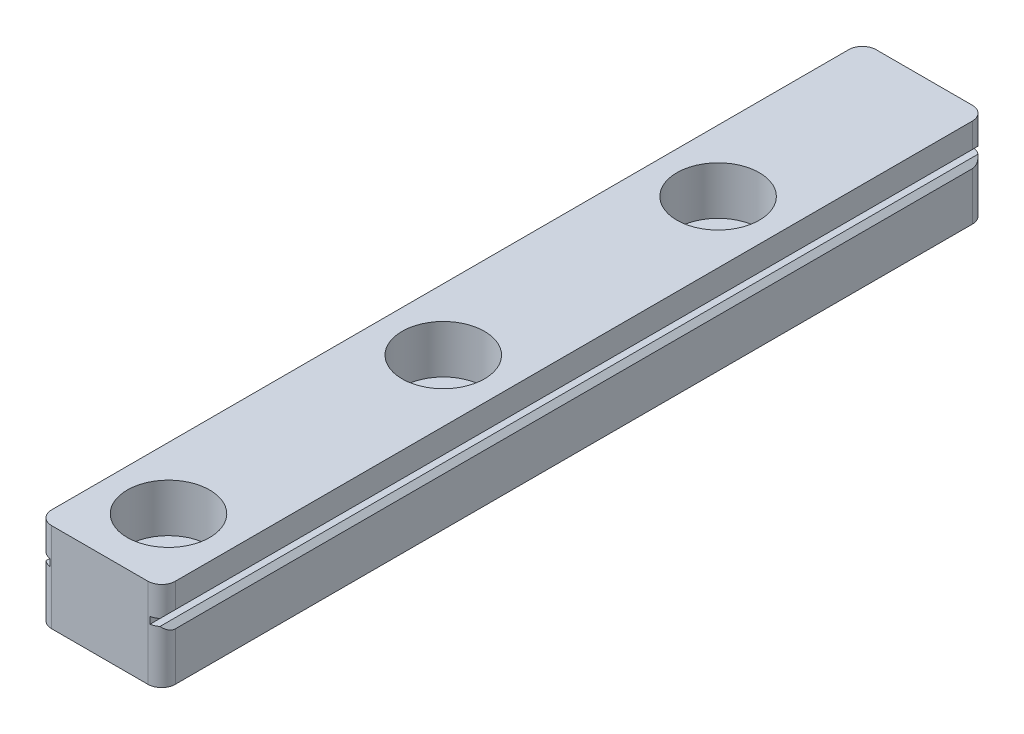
ISO-10303-21;
HEADER;
FILE_DESCRIPTION(('STEP AP214'),'2;1');
FILE_NAME('part.step','',(''),(''),'','','');
FILE_SCHEMA(('AUTOMOTIVE_DESIGN { 1 0 10303 214 1 1 1 1 }'));
ENDSEC;
DATA;
#1=APPLICATION_CONTEXT('core data for automotive mechanical design processes');
#2=APPLICATION_PROTOCOL_DEFINITION('international standard','automotive_design',2000,#1);
#3=PRODUCT_CONTEXT('',#1,'mechanical');
#4=PRODUCT('Part','Part','',(#3));
#5=PRODUCT_RELATED_PRODUCT_CATEGORY('part','',(#4));
#6=PRODUCT_DEFINITION_FORMATION('','',#4);
#7=PRODUCT_DEFINITION_CONTEXT('part definition',#1,'design');
#8=PRODUCT_DEFINITION('design','',#6,#7);
#9=PRODUCT_DEFINITION_SHAPE('','',#8);
#10=(LENGTH_UNIT() NAMED_UNIT(*) SI_UNIT(.MILLI.,.METRE.));
#11=(NAMED_UNIT(*) PLANE_ANGLE_UNIT() SI_UNIT($,.RADIAN.));
#12=(NAMED_UNIT(*) SI_UNIT($,.STERADIAN.) SOLID_ANGLE_UNIT());
#13=UNCERTAINTY_MEASURE_WITH_UNIT(LENGTH_MEASURE(1.E-05),#10,'distance_accuracy_value','');
#14=(GEOMETRIC_REPRESENTATION_CONTEXT(3) GLOBAL_UNCERTAINTY_ASSIGNED_CONTEXT((#13)) GLOBAL_UNIT_ASSIGNED_CONTEXT((#10,
#11,#12)) REPRESENTATION_CONTEXT('',''));
#15=CARTESIAN_POINT('',(0.,0.,0.));
#16=DIRECTION('',(0.,0.,1.));
#17=DIRECTION('',(1.,0.,0.));
#18=AXIS2_PLACEMENT_3D('',#15,#16,#17);
#19=CARTESIAN_POINT('',(0.,0.,-60.));
#20=DIRECTION('',(-1.,0.,0.));
#21=DIRECTION('',(0.,-1.,0.));
#22=AXIS2_PLACEMENT_3D('',#19,#20,#21);
#23=PLANE('',#22);
#24=DIRECTION('',(0.,0.,1.));
#25=VECTOR('',#24,1.);
#26=CARTESIAN_POINT('',(0.,3.5,-60.));
#27=LINE('',#26,#25);
#28=CARTESIAN_POINT('',(0.,3.5,-59.));
#29=VERTEX_POINT('',#28);
#30=CARTESIAN_POINT('',(0.,3.5,-1.));
#31=VERTEX_POINT('',#30);
#32=EDGE_CURVE('E204',#29,#31,#27,.T.);
#33=ORIENTED_EDGE('',*,*,#32,.F.);
#34=DIRECTION('',(0.,-1.,0.));
#35=VECTOR('',#34,1.);
#36=CARTESIAN_POINT('',(0.,0.,-59.));
#37=LINE('',#36,#35);
#38=CARTESIAN_POINT('',(0.,0.,-59.));
#39=VERTEX_POINT('',#38);
#40=EDGE_CURVE('E248',#29,#39,#37,.T.);
#41=ORIENTED_EDGE('',*,*,#40,.T.);
#42=DIRECTION('',(0.,0.,1.));
#43=VECTOR('',#42,1.);
#44=CARTESIAN_POINT('',(0.,0.,-60.));
#45=LINE('',#44,#43);
#46=CARTESIAN_POINT('',(0.,0.,-1.));
#47=VERTEX_POINT('',#46);
#48=EDGE_CURVE('E196',#39,#47,#45,.T.);
#49=ORIENTED_EDGE('',*,*,#48,.T.);
#50=DIRECTION('',(0.,-1.,0.));
#51=VECTOR('',#50,1.);
#52=CARTESIAN_POINT('',(0.,3.5,-1.));
#53=LINE('',#52,#51);
#54=EDGE_CURVE('E184',#47,#31,#53,.F.);
#55=ORIENTED_EDGE('',*,*,#54,.T.);
#56=EDGE_LOOP('',(#33,#41,#49,#55));
#57=FACE_BOUND('',#56,.T.);
#58=ADVANCED_FACE('F34',(#57),#23,.T.);
#59=CARTESIAN_POINT('',(0.,3.5,-60.));
#60=DIRECTION('',(-0.707106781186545,0.70710678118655,0.));
#61=DIRECTION('',(-0.70710678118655,-0.707106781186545,0.));
#62=AXIS2_PLACEMENT_3D('',#59,#60,#61);
#63=PLANE('',#62);
#64=DIRECTION('',(0.,0.,1.));
#65=VECTOR('',#64,1.);
#66=CARTESIAN_POINT('',(0.353553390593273,3.85355339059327,-60.));
#67=LINE('',#66,#65);
#68=CARTESIAN_POINT('',(0.353553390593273,3.85355339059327,-59.7629592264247));
#69=VERTEX_POINT('',#68);
#70=CARTESIAN_POINT('',(0.353553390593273,3.85355339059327,-0.237040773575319));
#71=VERTEX_POINT('',#70);
#72=EDGE_CURVE('E295',#69,#71,#67,.T.);
#73=ORIENTED_EDGE('',*,*,#72,.F.);
#74=CARTESIAN_POINT('',(0.999999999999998,4.49999999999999,-59.));
#75=DIRECTION('',(-0.707106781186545,0.70710678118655,0.));
#76=DIRECTION('',(-0.70710678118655,-0.707106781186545,0.));
#77=AXIS2_PLACEMENT_3D('',#74,#75,#76);
#78=ELLIPSE('',#77,1.41421356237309,1.);
#79=EDGE_CURVE('E271',#69,#29,#78,.T.);
#80=ORIENTED_EDGE('',*,*,#79,.T.);
#81=ORIENTED_EDGE('',*,*,#32,.T.);
#82=CARTESIAN_POINT('',(0.999999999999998,4.49999999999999,-1.));
#83=DIRECTION('',(-0.707106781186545,0.70710678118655,0.));
#84=DIRECTION('',(0.70710678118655,0.707106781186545,0.));
#85=AXIS2_PLACEMENT_3D('',#82,#83,#84);
#86=ELLIPSE('',#85,1.41421356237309,1.);
#87=EDGE_CURVE('E49',#31,#71,#86,.T.);
#88=ORIENTED_EDGE('',*,*,#87,.T.);
#89=EDGE_LOOP('',(#73,#80,#81,#88));
#90=FACE_BOUND('',#89,.T.);
#91=ADVANCED_FACE('F293',(#90),#63,.T.);
#92=CARTESIAN_POINT('',(0.353553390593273,3.85355339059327,-60.));
#93=DIRECTION('',(0.,1.,0.));
#94=DIRECTION('',(0.,0.,1.));
#95=AXIS2_PLACEMENT_3D('',#92,#93,#94);
#96=PLANE('',#95);
#97=DIRECTION('',(0.,0.,1.));
#98=VECTOR('',#97,1.);
#99=CARTESIAN_POINT('',(0.853553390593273,3.85355339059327,-60.));
#100=LINE('',#99,#98);
#101=CARTESIAN_POINT('',(0.853553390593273,3.85355339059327,-59.9892185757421));
#102=VERTEX_POINT('',#101);
#103=CARTESIAN_POINT('',(0.853553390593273,3.85355339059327,-0.0107814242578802));
#104=VERTEX_POINT('',#103);
#105=EDGE_CURVE('E297',#102,#104,#100,.T.);
#106=ORIENTED_EDGE('',*,*,#105,.F.);
#107=CARTESIAN_POINT('',(0.999999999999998,3.85355339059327,-59.));
#108=DIRECTION('',(0.,1.,0.));
#109=DIRECTION('',(0.,0.,1.));
#110=AXIS2_PLACEMENT_3D('',#107,#108,#109);
#111=CIRCLE('',#110,1.);
#112=EDGE_CURVE('E56',#102,#69,#111,.T.);
#113=ORIENTED_EDGE('',*,*,#112,.T.);
#114=ORIENTED_EDGE('',*,*,#72,.T.);
#115=CARTESIAN_POINT('',(0.999999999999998,3.85355339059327,-1.));
#116=DIRECTION('',(0.,1.,0.));
#117=DIRECTION('',(0.,0.,1.));
#118=AXIS2_PLACEMENT_3D('',#115,#116,#117);
#119=CIRCLE('',#118,1.);
#120=EDGE_CURVE('E267',#71,#104,#119,.T.);
#121=ORIENTED_EDGE('',*,*,#120,.T.);
#122=EDGE_LOOP('',(#106,#113,#114,#121));
#123=FACE_BOUND('',#122,.T.);
#124=ADVANCED_FACE('F433',(#123),#96,.T.);
#125=CARTESIAN_POINT('',(0.853553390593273,3.85355339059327,-60.));
#126=DIRECTION('',(-1.,0.,0.));
#127=DIRECTION('',(0.,0.,1.));
#128=AXIS2_PLACEMENT_3D('',#125,#126,#127);
#129=PLANE('',#128);
#130=DIRECTION('',(0.,0.,1.));
#131=VECTOR('',#130,1.);
#132=CARTESIAN_POINT('',(0.853553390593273,4.35355339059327,-60.));
#133=LINE('',#132,#131);
#134=CARTESIAN_POINT('',(0.853553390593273,4.35355339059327,-59.9892185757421));
#135=VERTEX_POINT('',#134);
#136=CARTESIAN_POINT('',(0.853553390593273,4.35355339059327,-0.0107814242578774));
#137=VERTEX_POINT('',#136);
#138=EDGE_CURVE('E303',#135,#137,#133,.T.);
#139=ORIENTED_EDGE('',*,*,#138,.F.);
#140=DIRECTION('',(0.,-1.,0.));
#141=VECTOR('',#140,1.);
#142=CARTESIAN_POINT('',(0.853553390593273,4.35355339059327,-59.9892185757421));
#143=LINE('',#142,#141);
#144=EDGE_CURVE('E265',#135,#102,#143,.T.);
#145=ORIENTED_EDGE('',*,*,#144,.T.);
#146=ORIENTED_EDGE('',*,*,#105,.T.);
#147=DIRECTION('',(0.,1.,0.));
#148=VECTOR('',#147,1.);
#149=CARTESIAN_POINT('',(0.853553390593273,3.85355339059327,-0.010781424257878));
#150=LINE('',#149,#148);
#151=EDGE_CURVE('E263',#104,#137,#150,.T.);
#152=ORIENTED_EDGE('',*,*,#151,.T.);
#153=EDGE_LOOP('',(#139,#145,#146,#152));
#154=FACE_BOUND('',#153,.T.);
#155=ADVANCED_FACE('F432',(#154),#129,.T.);
#156=CARTESIAN_POINT('',(0.853553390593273,4.35355339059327,-60.));
#157=DIRECTION('',(0.,-1.,0.));
#158=DIRECTION('',(0.,0.,-1.));
#159=AXIS2_PLACEMENT_3D('',#156,#157,#158);
#160=PLANE('',#159);
#161=DIRECTION('',(0.,0.,1.));
#162=VECTOR('',#161,1.);
#163=CARTESIAN_POINT('',(0.353553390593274,4.35355339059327,-60.));
#164=LINE('',#163,#162);
#165=CARTESIAN_POINT('',(0.353553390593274,4.35355339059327,-59.7629592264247));
#166=VERTEX_POINT('',#165);
#167=CARTESIAN_POINT('',(0.353553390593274,4.35355339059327,-0.237040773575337));
#168=VERTEX_POINT('',#167);
#169=EDGE_CURVE('E306',#166,#168,#164,.T.);
#170=ORIENTED_EDGE('',*,*,#169,.F.);
#171=CARTESIAN_POINT('',(0.999999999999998,4.35355339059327,-59.));
#172=DIRECTION('',(0.,-1.,0.));
#173=DIRECTION('',(0.,0.,-1.));
#174=AXIS2_PLACEMENT_3D('',#171,#172,#173);
#175=CIRCLE('',#174,1.);
#176=EDGE_CURVE('E261',#166,#135,#175,.T.);
#177=ORIENTED_EDGE('',*,*,#176,.T.);
#178=ORIENTED_EDGE('',*,*,#138,.T.);
#179=CARTESIAN_POINT('',(1.,4.35355339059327,-1.));
#180=DIRECTION('',(0.,-1.,0.));
#181=DIRECTION('',(0.,0.,-1.));
#182=AXIS2_PLACEMENT_3D('',#179,#180,#181);
#183=CIRCLE('',#182,1.);
#184=EDGE_CURVE('E259',#137,#168,#183,.T.);
#185=ORIENTED_EDGE('',*,*,#184,.T.);
#186=EDGE_LOOP('',(#170,#177,#178,#185));
#187=FACE_BOUND('',#186,.T.);
#188=ADVANCED_FACE('F428',(#187),#160,.T.);
#189=CARTESIAN_POINT('',(0.353553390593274,4.35355339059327,-60.));
#190=DIRECTION('',(-0.707106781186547,-0.707106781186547,0.));
#191=DIRECTION('',(0.707106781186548,-0.707106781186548,0.));
#192=AXIS2_PLACEMENT_3D('',#189,#190,#191);
#193=PLANE('',#192);
#194=DIRECTION('',(0.,0.,1.));
#195=VECTOR('',#194,1.);
#196=CARTESIAN_POINT('',(0.,4.70710678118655,-60.));
#197=LINE('',#196,#195);
#198=CARTESIAN_POINT('',(0.,4.70710678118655,-59.));
#199=VERTEX_POINT('',#198);
#200=CARTESIAN_POINT('',(0.,4.70710678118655,-1.));
#201=VERTEX_POINT('',#200);
#202=EDGE_CURVE('E309',#199,#201,#197,.T.);
#203=ORIENTED_EDGE('',*,*,#202,.F.);
#204=CARTESIAN_POINT('',(0.999999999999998,3.70710678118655,-59.));
#205=DIRECTION('',(-0.707106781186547,-0.707106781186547,0.));
#206=DIRECTION('',(0.707106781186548,-0.707106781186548,0.));
#207=AXIS2_PLACEMENT_3D('',#204,#205,#206);
#208=ELLIPSE('',#207,1.4142135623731,1.);
#209=EDGE_CURVE('E257',#199,#166,#208,.T.);
#210=ORIENTED_EDGE('',*,*,#209,.T.);
#211=ORIENTED_EDGE('',*,*,#169,.T.);
#212=CARTESIAN_POINT('',(1.,3.70710678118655,-1.));
#213=DIRECTION('',(-0.707106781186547,-0.707106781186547,0.));
#214=DIRECTION('',(-0.707106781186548,0.707106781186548,0.));
#215=AXIS2_PLACEMENT_3D('',#212,#213,#214);
#216=ELLIPSE('',#215,1.4142135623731,1.);
#217=EDGE_CURVE('E255',#168,#201,#216,.T.);
#218=ORIENTED_EDGE('',*,*,#217,.T.);
#219=EDGE_LOOP('',(#203,#210,#211,#218));
#220=FACE_BOUND('',#219,.T.);
#221=ADVANCED_FACE('F424',(#220),#193,.T.);
#222=CARTESIAN_POINT('',(0.,4.70710678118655,-60.));
#223=DIRECTION('',(-1.,0.,0.));
#224=DIRECTION('',(0.,0.,1.));
#225=AXIS2_PLACEMENT_3D('',#222,#223,#224);
#226=PLANE('',#225);
#227=DIRECTION('',(0.,0.,1.));
#228=VECTOR('',#227,1.);
#229=CARTESIAN_POINT('',(0.,6.5,-60.));
#230=LINE('',#229,#228);
#231=CARTESIAN_POINT('',(0.,6.5,-59.));
#232=VERTEX_POINT('',#231);
#233=CARTESIAN_POINT('',(0.,6.5,-1.));
#234=VERTEX_POINT('',#233);
#235=EDGE_CURVE('E312',#232,#234,#230,.T.);
#236=ORIENTED_EDGE('',*,*,#235,.F.);
#237=DIRECTION('',(0.,-1.,0.));
#238=VECTOR('',#237,1.);
#239=CARTESIAN_POINT('',(0.,5.60355339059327,-59.));
#240=LINE('',#239,#238);
#241=EDGE_CURVE('E253',#232,#199,#240,.T.);
#242=ORIENTED_EDGE('',*,*,#241,.T.);
#243=ORIENTED_EDGE('',*,*,#202,.T.);
#244=DIRECTION('',(0.,-1.,0.));
#245=VECTOR('',#244,1.);
#246=CARTESIAN_POINT('',(0.,6.5,-1.));
#247=LINE('',#246,#245);
#248=EDGE_CURVE('E251',#201,#234,#247,.F.);
#249=ORIENTED_EDGE('',*,*,#248,.T.);
#250=EDGE_LOOP('',(#236,#242,#243,#249));
#251=FACE_BOUND('',#250,.T.);
#252=ADVANCED_FACE('F398',(#251),#226,.T.);
#253=CARTESIAN_POINT('',(9.,6.5,-60.));
#254=DIRECTION('',(0.,1.,0.));
#255=DIRECTION('',(0.,0.,1.));
#256=AXIS2_PLACEMENT_3D('',#253,#254,#255);
#257=PLANE('',#256);
#258=CARTESIAN_POINT('',(4.5,6.5,-25.));
#259=DIRECTION('',(0.,1.,0.));
#260=DIRECTION('',(0.,0.,1.));
#261=AXIS2_PLACEMENT_3D('',#258,#259,#260);
#262=CIRCLE('',#261,3.);
#263=CARTESIAN_POINT('',(4.5,6.5,-22.));
#264=VERTEX_POINT('',#263);
#265=EDGE_CURVE('E353',#264,#264,#262,.T.);
#266=ORIENTED_EDGE('',*,*,#265,.F.);
#267=EDGE_LOOP('',(#266));
#268=FACE_BOUND('',#267,.T.);
#269=CARTESIAN_POINT('',(4.5,6.5,-45.));
#270=DIRECTION('',(0.,1.,0.));
#271=DIRECTION('',(0.,0.,1.));
#272=AXIS2_PLACEMENT_3D('',#269,#270,#271);
#273=CIRCLE('',#272,3.);
#274=CARTESIAN_POINT('',(4.5,6.5,-42.));
#275=VERTEX_POINT('',#274);
#276=EDGE_CURVE('E347',#275,#275,#273,.T.);
#277=ORIENTED_EDGE('',*,*,#276,.F.);
#278=EDGE_LOOP('',(#277));
#279=FACE_BOUND('',#278,.T.);
#280=CARTESIAN_POINT('',(4.5,6.5,-5.));
#281=DIRECTION('',(0.,1.,0.));
#282=DIRECTION('',(0.,0.,1.));
#283=AXIS2_PLACEMENT_3D('',#280,#281,#282);
#284=CIRCLE('',#283,3.);
#285=CARTESIAN_POINT('',(4.5,6.5,-2.));
#286=VERTEX_POINT('',#285);
#287=EDGE_CURVE('E341',#286,#286,#284,.T.);
#288=ORIENTED_EDGE('',*,*,#287,.F.);
#289=EDGE_LOOP('',(#288));
#290=FACE_BOUND('',#289,.T.);
#291=DIRECTION('',(0.,0.,1.));
#292=VECTOR('',#291,1.);
#293=CARTESIAN_POINT('',(9.,6.5,-60.));
#294=LINE('',#293,#292);
#295=CARTESIAN_POINT('',(9.,6.5,-59.));
#296=VERTEX_POINT('',#295);
#297=CARTESIAN_POINT('',(9.,6.5,-1.));
#298=VERTEX_POINT('',#297);
#299=EDGE_CURVE('E315',#296,#298,#294,.T.);
#300=ORIENTED_EDGE('',*,*,#299,.F.);
#301=CARTESIAN_POINT('',(8.,6.5,-59.));
#302=DIRECTION('',(0.,1.,0.));
#303=DIRECTION('',(0.,0.,1.));
#304=AXIS2_PLACEMENT_3D('',#301,#302,#303);
#305=CIRCLE('',#304,1.);
#306=CARTESIAN_POINT('',(8.,6.5,-60.));
#307=VERTEX_POINT('',#306);
#308=EDGE_CURVE('E236',#296,#307,#305,.T.);
#309=ORIENTED_EDGE('',*,*,#308,.T.);
#310=DIRECTION('',(-1.,0.,0.));
#311=VECTOR('',#310,1.);
#312=CARTESIAN_POINT('',(9.,6.5,-60.));
#313=LINE('',#312,#311);
#314=CARTESIAN_POINT('',(0.999999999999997,6.5,-60.));
#315=VERTEX_POINT('',#314);
#316=EDGE_CURVE('E333',#307,#315,#313,.T.);
#317=ORIENTED_EDGE('',*,*,#316,.T.);
#318=CARTESIAN_POINT('',(0.999999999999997,6.5,-59.));
#319=DIRECTION('',(0.,1.,0.));
#320=DIRECTION('',(0.,0.,1.));
#321=AXIS2_PLACEMENT_3D('',#318,#319,#320);
#322=CIRCLE('',#321,1.);
#323=EDGE_CURVE('E234',#315,#232,#322,.T.);
#324=ORIENTED_EDGE('',*,*,#323,.T.);
#325=ORIENTED_EDGE('',*,*,#235,.T.);
#326=CARTESIAN_POINT('',(1.,6.5,-1.));
#327=DIRECTION('',(0.,1.,0.));
#328=DIRECTION('',(0.,0.,1.));
#329=AXIS2_PLACEMENT_3D('',#326,#327,#328);
#330=CIRCLE('',#329,1.);
#331=CARTESIAN_POINT('',(1.,6.5,0.));
#332=VERTEX_POINT('',#331);
#333=EDGE_CURVE('E229',#234,#332,#330,.T.);
#334=ORIENTED_EDGE('',*,*,#333,.T.);
#335=DIRECTION('',(-1.,0.,0.));
#336=VECTOR('',#335,1.);
#337=CARTESIAN_POINT('',(9.,6.5,0.));
#338=LINE('',#337,#336);
#339=CARTESIAN_POINT('',(8.,6.5,0.));
#340=VERTEX_POINT('',#339);
#341=EDGE_CURVE('E280',#340,#332,#338,.T.);
#342=ORIENTED_EDGE('',*,*,#341,.F.);
#343=CARTESIAN_POINT('',(8.,6.5,-1.));
#344=DIRECTION('',(0.,1.,0.));
#345=DIRECTION('',(0.,0.,1.));
#346=AXIS2_PLACEMENT_3D('',#343,#344,#345);
#347=CIRCLE('',#346,1.);
#348=EDGE_CURVE('E232',#340,#298,#347,.T.);
#349=ORIENTED_EDGE('',*,*,#348,.T.);
#350=EDGE_LOOP('',(#300,#309,#317,#324,#325,#334,#342,#349));
#351=FACE_BOUND('',#350,.T.);
#352=ADVANCED_FACE('F394',(#268,#279,#290,#351),#257,.T.);
#353=CARTESIAN_POINT('',(9.,4.70710678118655,-60.));
#354=DIRECTION('',(1.,0.,0.));
#355=DIRECTION('',(0.,1.,0.));
#356=AXIS2_PLACEMENT_3D('',#353,#354,#355);
#357=PLANE('',#356);
#358=DIRECTION('',(0.,0.,1.));
#359=VECTOR('',#358,1.);
#360=CARTESIAN_POINT('',(9.,4.70710678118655,-60.));
#361=LINE('',#360,#359);
#362=CARTESIAN_POINT('',(9.,4.70710678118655,-59.));
#363=VERTEX_POINT('',#362);
#364=CARTESIAN_POINT('',(9.,4.70710678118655,-1.));
#365=VERTEX_POINT('',#364);
#366=EDGE_CURVE('E318',#363,#365,#361,.T.);
#367=ORIENTED_EDGE('',*,*,#366,.F.);
#368=DIRECTION('',(0.,1.,0.));
#369=VECTOR('',#368,1.);
#370=CARTESIAN_POINT('',(9.,5.60355339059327,-59.));
#371=LINE('',#370,#369);
#372=EDGE_CURVE('E227',#363,#296,#371,.T.);
#373=ORIENTED_EDGE('',*,*,#372,.T.);
#374=ORIENTED_EDGE('',*,*,#299,.T.);
#375=DIRECTION('',(0.,-1.,0.));
#376=VECTOR('',#375,1.);
#377=CARTESIAN_POINT('',(9.,5.60355339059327,-1.));
#378=LINE('',#377,#376);
#379=EDGE_CURVE('E225',#298,#365,#378,.T.);
#380=ORIENTED_EDGE('',*,*,#379,.T.);
#381=EDGE_LOOP('',(#367,#373,#374,#380));
#382=FACE_BOUND('',#381,.T.);
#383=ADVANCED_FACE('F397',(#382),#357,.T.);
#384=CARTESIAN_POINT('',(8.64644660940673,4.35355339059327,-60.));
#385=DIRECTION('',(0.707106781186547,-0.707106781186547,0.));
#386=DIRECTION('',(0.707106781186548,0.707106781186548,0.));
#387=AXIS2_PLACEMENT_3D('',#384,#385,#386);
#388=PLANE('',#387);
#389=DIRECTION('',(0.,0.,1.));
#390=VECTOR('',#389,1.);
#391=CARTESIAN_POINT('',(8.64644660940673,4.35355339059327,-60.));
#392=LINE('',#391,#390);
#393=CARTESIAN_POINT('',(8.64644660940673,4.35355339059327,-59.7629592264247));
#394=VERTEX_POINT('',#393);
#395=CARTESIAN_POINT('',(8.64644660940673,4.35355339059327,-0.237040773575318));
#396=VERTEX_POINT('',#395);
#397=EDGE_CURVE('E321',#394,#396,#392,.T.);
#398=ORIENTED_EDGE('',*,*,#397,.F.);
#399=CARTESIAN_POINT('',(8.,3.70710678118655,-59.));
#400=DIRECTION('',(0.707106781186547,-0.707106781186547,0.));
#401=DIRECTION('',(0.707106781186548,0.707106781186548,0.));
#402=AXIS2_PLACEMENT_3D('',#399,#400,#401);
#403=ELLIPSE('',#402,1.4142135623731,1.);
#404=EDGE_CURVE('E223',#394,#363,#403,.T.);
#405=ORIENTED_EDGE('',*,*,#404,.T.);
#406=ORIENTED_EDGE('',*,*,#366,.T.);
#407=CARTESIAN_POINT('',(8.,3.70710678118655,-1.));
#408=DIRECTION('',(0.707106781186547,-0.707106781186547,0.));
#409=DIRECTION('',(-0.707106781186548,-0.707106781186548,0.));
#410=AXIS2_PLACEMENT_3D('',#407,#408,#409);
#411=ELLIPSE('',#410,1.4142135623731,1.);
#412=EDGE_CURVE('E221',#365,#396,#411,.T.);
#413=ORIENTED_EDGE('',*,*,#412,.T.);
#414=EDGE_LOOP('',(#398,#405,#406,#413));
#415=FACE_BOUND('',#414,.T.);
#416=ADVANCED_FACE('F464',(#415),#388,.T.);
#417=CARTESIAN_POINT('',(8.14644660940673,4.35355339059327,-60.));
#418=DIRECTION('',(0.,-1.,0.));
#419=DIRECTION('',(0.,0.,-1.));
#420=AXIS2_PLACEMENT_3D('',#417,#418,#419);
#421=PLANE('',#420);
#422=DIRECTION('',(0.,0.,1.));
#423=VECTOR('',#422,1.);
#424=CARTESIAN_POINT('',(8.14644660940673,4.35355339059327,-60.));
#425=LINE('',#424,#423);
#426=CARTESIAN_POINT('',(8.14644660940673,4.35355339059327,-59.9892185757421));
#427=VERTEX_POINT('',#426);
#428=CARTESIAN_POINT('',(8.14644660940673,4.35355339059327,-0.0107814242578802));
#429=VERTEX_POINT('',#428);
#430=EDGE_CURVE('E324',#427,#429,#425,.T.);
#431=ORIENTED_EDGE('',*,*,#430,.F.);
#432=CARTESIAN_POINT('',(8.,4.35355339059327,-59.));
#433=DIRECTION('',(0.,-1.,0.));
#434=DIRECTION('',(0.,0.,-1.));
#435=AXIS2_PLACEMENT_3D('',#432,#433,#434);
#436=CIRCLE('',#435,1.);
#437=EDGE_CURVE('E219',#427,#394,#436,.T.);
#438=ORIENTED_EDGE('',*,*,#437,.T.);
#439=ORIENTED_EDGE('',*,*,#397,.T.);
#440=CARTESIAN_POINT('',(8.,4.35355339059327,-1.));
#441=DIRECTION('',(0.,-1.,0.));
#442=DIRECTION('',(0.,0.,-1.));
#443=AXIS2_PLACEMENT_3D('',#440,#441,#442);
#444=CIRCLE('',#443,1.);
#445=EDGE_CURVE('E217',#396,#429,#444,.T.);
#446=ORIENTED_EDGE('',*,*,#445,.T.);
#447=EDGE_LOOP('',(#431,#438,#439,#446));
#448=FACE_BOUND('',#447,.T.);
#449=ADVANCED_FACE('F469',(#448),#421,.T.);
#450=CARTESIAN_POINT('',(8.14644660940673,3.85355339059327,-60.));
#451=DIRECTION('',(1.,0.,0.));
#452=DIRECTION('',(0.,0.,-1.));
#453=AXIS2_PLACEMENT_3D('',#450,#451,#452);
#454=PLANE('',#453);
#455=DIRECTION('',(0.,0.,1.));
#456=VECTOR('',#455,1.);
#457=CARTESIAN_POINT('',(8.14644660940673,3.85355339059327,-60.));
#458=LINE('',#457,#456);
#459=CARTESIAN_POINT('',(8.14644660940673,3.85355339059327,-59.9892185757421));
#460=VERTEX_POINT('',#459);
#461=CARTESIAN_POINT('',(8.14644660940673,3.85355339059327,-0.0107814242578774));
#462=VERTEX_POINT('',#461);
#463=EDGE_CURVE('E327',#460,#462,#458,.T.);
#464=ORIENTED_EDGE('',*,*,#463,.F.);
#465=DIRECTION('',(0.,1.,0.));
#466=VECTOR('',#465,1.);
#467=CARTESIAN_POINT('',(8.14644660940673,3.85355339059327,-59.9892185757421));
#468=LINE('',#467,#466);
#469=EDGE_CURVE('E215',#460,#427,#468,.T.);
#470=ORIENTED_EDGE('',*,*,#469,.T.);
#471=ORIENTED_EDGE('',*,*,#430,.T.);
#472=DIRECTION('',(0.,-1.,0.));
#473=VECTOR('',#472,1.);
#474=CARTESIAN_POINT('',(8.14644660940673,4.35355339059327,-0.0107814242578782));
#475=LINE('',#474,#473);
#476=EDGE_CURVE('E213',#429,#462,#475,.T.);
#477=ORIENTED_EDGE('',*,*,#476,.T.);
#478=EDGE_LOOP('',(#464,#470,#471,#477));
#479=FACE_BOUND('',#478,.T.);
#480=ADVANCED_FACE('F473',(#479),#454,.T.);
#481=CARTESIAN_POINT('',(8.64644660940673,3.85355339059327,-60.));
#482=DIRECTION('',(0.,1.,0.));
#483=DIRECTION('',(0.,0.,1.));
#484=AXIS2_PLACEMENT_3D('',#481,#482,#483);
#485=PLANE('',#484);
#486=DIRECTION('',(0.,0.,1.));
#487=VECTOR('',#486,1.);
#488=CARTESIAN_POINT('',(8.64644660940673,3.85355339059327,-60.));
#489=LINE('',#488,#487);
#490=CARTESIAN_POINT('',(8.64644660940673,3.85355339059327,-59.7629592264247));
#491=VERTEX_POINT('',#490);
#492=CARTESIAN_POINT('',(8.64644660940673,3.85355339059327,-0.237040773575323));
#493=VERTEX_POINT('',#492);
#494=EDGE_CURVE('E330',#491,#493,#489,.T.);
#495=ORIENTED_EDGE('',*,*,#494,.F.);
#496=CARTESIAN_POINT('',(8.,3.85355339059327,-59.));
#497=DIRECTION('',(0.,1.,0.));
#498=DIRECTION('',(0.,0.,1.));
#499=AXIS2_PLACEMENT_3D('',#496,#497,#498);
#500=CIRCLE('',#499,1.);
#501=EDGE_CURVE('E211',#491,#460,#500,.T.);
#502=ORIENTED_EDGE('',*,*,#501,.T.);
#503=ORIENTED_EDGE('',*,*,#463,.T.);
#504=CARTESIAN_POINT('',(8.,3.85355339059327,-1.));
#505=DIRECTION('',(0.,1.,0.));
#506=DIRECTION('',(0.,0.,1.));
#507=AXIS2_PLACEMENT_3D('',#504,#505,#506);
#508=CIRCLE('',#507,1.);
#509=EDGE_CURVE('E209',#462,#493,#508,.T.);
#510=ORIENTED_EDGE('',*,*,#509,.T.);
#511=EDGE_LOOP('',(#495,#502,#503,#510));
#512=FACE_BOUND('',#511,.T.);
#513=ADVANCED_FACE('F477',(#512),#485,.T.);
#514=CARTESIAN_POINT('',(9.,3.5,-60.));
#515=DIRECTION('',(0.707106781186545,0.70710678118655,0.));
#516=DIRECTION('',(-0.70710678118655,0.707106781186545,0.));
#517=AXIS2_PLACEMENT_3D('',#514,#515,#516);
#518=PLANE('',#517);
#519=DIRECTION('',(0.,0.,1.));
#520=VECTOR('',#519,1.);
#521=CARTESIAN_POINT('',(9.,3.5,-60.));
#522=LINE('',#521,#520);
#523=CARTESIAN_POINT('',(9.,3.5,-59.));
#524=VERTEX_POINT('',#523);
#525=CARTESIAN_POINT('',(9.,3.5,-1.));
#526=VERTEX_POINT('',#525);
#527=EDGE_CURVE('E195',#524,#526,#522,.T.);
#528=ORIENTED_EDGE('',*,*,#527,.F.);
#529=CARTESIAN_POINT('',(8.,4.49999999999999,-59.));
#530=DIRECTION('',(0.707106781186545,0.70710678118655,0.));
#531=DIRECTION('',(-0.70710678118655,0.707106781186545,0.));
#532=AXIS2_PLACEMENT_3D('',#529,#530,#531);
#533=ELLIPSE('',#532,1.41421356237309,1.);
#534=EDGE_CURVE('E200',#524,#491,#533,.T.);
#535=ORIENTED_EDGE('',*,*,#534,.T.);
#536=ORIENTED_EDGE('',*,*,#494,.T.);
#537=CARTESIAN_POINT('',(8.,4.49999999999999,-1.));
#538=DIRECTION('',(0.707106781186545,0.70710678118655,0.));
#539=DIRECTION('',(0.70710678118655,-0.707106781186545,0.));
#540=AXIS2_PLACEMENT_3D('',#537,#538,#539);
#541=ELLIPSE('',#540,1.41421356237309,1.);
#542=EDGE_CURVE('E201',#493,#526,#541,.T.);
#543=ORIENTED_EDGE('',*,*,#542,.T.);
#544=EDGE_LOOP('',(#528,#535,#536,#543));
#545=FACE_BOUND('',#544,.T.);
#546=ADVANCED_FACE('F479',(#545),#518,.T.);
#547=CARTESIAN_POINT('',(9.,0.,-60.));
#548=DIRECTION('',(1.,0.,0.));
#549=DIRECTION('',(0.,0.,-1.));
#550=AXIS2_PLACEMENT_3D('',#547,#548,#549);
#551=PLANE('',#550);
#552=DIRECTION('',(0.,0.,1.));
#553=VECTOR('',#552,1.);
#554=CARTESIAN_POINT('',(9.,0.,-60.));
#555=LINE('',#554,#553);
#556=CARTESIAN_POINT('',(9.,0.,-59.));
#557=VERTEX_POINT('',#556);
#558=CARTESIAN_POINT('',(9.,0.,-1.));
#559=VERTEX_POINT('',#558);
#560=EDGE_CURVE('E177',#557,#559,#555,.T.);
#561=ORIENTED_EDGE('',*,*,#560,.F.);
#562=DIRECTION('',(0.,1.,0.));
#563=VECTOR('',#562,1.);
#564=CARTESIAN_POINT('',(9.,0.,-59.));
#565=LINE('',#564,#563);
#566=EDGE_CURVE('E191',#557,#524,#565,.T.);
#567=ORIENTED_EDGE('',*,*,#566,.T.);
#568=ORIENTED_EDGE('',*,*,#527,.T.);
#569=DIRECTION('',(0.,1.,0.));
#570=VECTOR('',#569,1.);
#571=CARTESIAN_POINT('',(9.,0.,-1.));
#572=LINE('',#571,#570);
#573=EDGE_CURVE('E194',#526,#559,#572,.F.);
#574=ORIENTED_EDGE('',*,*,#573,.T.);
#575=EDGE_LOOP('',(#561,#567,#568,#574));
#576=FACE_BOUND('',#575,.T.);
#577=ADVANCED_FACE('F189',(#576),#551,.T.);
#578=CARTESIAN_POINT('',(0.,0.,-60.));
#579=DIRECTION('',(0.,-1.,0.));
#580=DIRECTION('',(0.,0.,-1.));
#581=AXIS2_PLACEMENT_3D('',#578,#579,#580);
#582=PLANE('',#581);
#583=CARTESIAN_POINT('',(4.5,0.,-25.));
#584=DIRECTION('',(0.,-1.,0.));
#585=DIRECTION('',(0.,0.,-1.));
#586=AXIS2_PLACEMENT_3D('',#583,#584,#585);
#587=CIRCLE('',#586,1.75);
#588=CARTESIAN_POINT('',(4.5,0.,-26.75));
#589=VERTEX_POINT('',#588);
#590=EDGE_CURVE('E370',#589,#589,#587,.F.);
#591=ORIENTED_EDGE('',*,*,#590,.T.);
#592=EDGE_LOOP('',(#591));
#593=FACE_BOUND('',#592,.T.);
#594=CARTESIAN_POINT('',(4.5,0.,-45.));
#595=DIRECTION('',(0.,-1.,0.));
#596=DIRECTION('',(0.,0.,-1.));
#597=AXIS2_PLACEMENT_3D('',#594,#595,#596);
#598=CIRCLE('',#597,1.75);
#599=CARTESIAN_POINT('',(4.5,0.,-46.75));
#600=VERTEX_POINT('',#599);
#601=EDGE_CURVE('E364',#600,#600,#598,.F.);
#602=ORIENTED_EDGE('',*,*,#601,.T.);
#603=EDGE_LOOP('',(#602));
#604=FACE_BOUND('',#603,.T.);
#605=CARTESIAN_POINT('',(4.5,0.,-5.));
#606=DIRECTION('',(0.,-1.,0.));
#607=DIRECTION('',(0.,0.,-1.));
#608=AXIS2_PLACEMENT_3D('',#605,#606,#607);
#609=CIRCLE('',#608,1.75);
#610=CARTESIAN_POINT('',(4.5,0.,-6.75));
#611=VERTEX_POINT('',#610);
#612=EDGE_CURVE('E356',#611,#611,#609,.F.);
#613=ORIENTED_EDGE('',*,*,#612,.T.);
#614=EDGE_LOOP('',(#613));
#615=FACE_BOUND('',#614,.T.);
#616=DIRECTION('',(1.,0.,0.));
#617=VECTOR('',#616,1.);
#618=CARTESIAN_POINT('',(0.,0.,-60.));
#619=LINE('',#618,#617);
#620=CARTESIAN_POINT('',(1.,0.,-60.));
#621=VERTEX_POINT('',#620);
#622=CARTESIAN_POINT('',(8.,0.,-60.));
#623=VERTEX_POINT('',#622);
#624=EDGE_CURVE('E180',#621,#623,#619,.T.);
#625=ORIENTED_EDGE('',*,*,#624,.T.);
#626=CARTESIAN_POINT('',(8.,0.,-59.));
#627=DIRECTION('',(0.,-1.,0.));
#628=DIRECTION('',(0.,0.,-1.));
#629=AXIS2_PLACEMENT_3D('',#626,#627,#628);
#630=CIRCLE('',#629,1.);
#631=EDGE_CURVE('E174',#623,#557,#630,.T.);
#632=ORIENTED_EDGE('',*,*,#631,.T.);
#633=ORIENTED_EDGE('',*,*,#560,.T.);
#634=CARTESIAN_POINT('',(8.,0.,-1.));
#635=DIRECTION('',(0.,-1.,0.));
#636=DIRECTION('',(0.,0.,-1.));
#637=AXIS2_PLACEMENT_3D('',#634,#635,#636);
#638=CIRCLE('',#637,1.);
#639=CARTESIAN_POINT('',(8.,0.,0.));
#640=VERTEX_POINT('',#639);
#641=EDGE_CURVE('E244',#559,#640,#638,.T.);
#642=ORIENTED_EDGE('',*,*,#641,.T.);
#643=DIRECTION('',(1.,0.,0.));
#644=VECTOR('',#643,1.);
#645=CARTESIAN_POINT('',(0.,0.,0.));
#646=LINE('',#645,#644);
#647=CARTESIAN_POINT('',(1.,0.,0.));
#648=VERTEX_POINT('',#647);
#649=EDGE_CURVE('E277',#648,#640,#646,.T.);
#650=ORIENTED_EDGE('',*,*,#649,.F.);
#651=CARTESIAN_POINT('',(1.,0.,-1.));
#652=DIRECTION('',(0.,-1.,0.));
#653=DIRECTION('',(0.,0.,-1.));
#654=AXIS2_PLACEMENT_3D('',#651,#652,#653);
#655=CIRCLE('',#654,1.);
#656=EDGE_CURVE('E242',#648,#47,#655,.T.);
#657=ORIENTED_EDGE('',*,*,#656,.T.);
#658=ORIENTED_EDGE('',*,*,#48,.F.);
#659=CARTESIAN_POINT('',(1.,0.,-59.));
#660=DIRECTION('',(0.,-1.,0.));
#661=DIRECTION('',(0.,0.,-1.));
#662=AXIS2_PLACEMENT_3D('',#659,#660,#661);
#663=CIRCLE('',#662,1.);
#664=EDGE_CURVE('E185',#39,#621,#663,.T.);
#665=ORIENTED_EDGE('',*,*,#664,.T.);
#666=EDGE_LOOP('',(#625,#632,#633,#642,#650,#657,#658,#665));
#667=FACE_BOUND('',#666,.T.);
#668=ADVANCED_FACE('F176',(#593,#604,#615,#667),#582,.T.);
#669=CARTESIAN_POINT('',(0.,0.,-60.));
#670=DIRECTION('',(0.,0.,-1.));
#671=DIRECTION('',(-1.,0.,0.));
#672=AXIS2_PLACEMENT_3D('',#669,#670,#671);
#673=PLANE('',#672);
#674=ORIENTED_EDGE('',*,*,#316,.F.);
#675=DIRECTION('',(0.,1.,0.));
#676=VECTOR('',#675,1.);
#677=CARTESIAN_POINT('',(8.,0.,-60.));
#678=LINE('',#677,#676);
#679=EDGE_CURVE('E240',#307,#623,#678,.F.);
#680=ORIENTED_EDGE('',*,*,#679,.T.);
#681=ORIENTED_EDGE('',*,*,#624,.F.);
#682=DIRECTION('',(0.,-1.,0.));
#683=VECTOR('',#682,1.);
#684=CARTESIAN_POINT('',(1.,0.,-60.));
#685=LINE('',#684,#683);
#686=EDGE_CURVE('E238',#621,#315,#685,.F.);
#687=ORIENTED_EDGE('',*,*,#686,.T.);
#688=EDGE_LOOP('',(#674,#680,#681,#687));
#689=FACE_BOUND('',#688,.T.);
#690=ADVANCED_FACE('F410',(#689),#673,.T.);
#691=CARTESIAN_POINT('',(0.,0.,0.));
#692=DIRECTION('',(0.,0.,-1.));
#693=DIRECTION('',(-1.,0.,0.));
#694=AXIS2_PLACEMENT_3D('',#691,#692,#693);
#695=PLANE('',#694);
#696=ORIENTED_EDGE('',*,*,#649,.T.);
#697=DIRECTION('',(0.,1.,0.));
#698=VECTOR('',#697,1.);
#699=CARTESIAN_POINT('',(8.,3.5,0.));
#700=LINE('',#699,#698);
#701=EDGE_CURVE('E11',#640,#340,#700,.T.);
#702=ORIENTED_EDGE('',*,*,#701,.T.);
#703=ORIENTED_EDGE('',*,*,#341,.T.);
#704=DIRECTION('',(0.,-1.,0.));
#705=VECTOR('',#704,1.);
#706=CARTESIAN_POINT('',(1.,0.,0.));
#707=LINE('',#706,#705);
#708=EDGE_CURVE('E42',#332,#648,#707,.T.);
#709=ORIENTED_EDGE('',*,*,#708,.T.);
#710=EDGE_LOOP('',(#696,#702,#703,#709));
#711=FACE_BOUND('',#710,.T.);
#712=ADVANCED_FACE('F276',(#711),#695,.F.);
#713=CARTESIAN_POINT('',(4.5,3.,-5.));
#714=DIRECTION('',(0.,1.,0.));
#715=DIRECTION('',(0.,0.,1.));
#716=AXIS2_PLACEMENT_3D('',#713,#714,#715);
#717=CYLINDRICAL_SURFACE('',#716,3.);
#718=CARTESIAN_POINT('',(4.5,3.,-5.));
#719=DIRECTION('',(0.,1.,0.));
#720=DIRECTION('',(0.,0.,1.));
#721=AXIS2_PLACEMENT_3D('',#718,#719,#720);
#722=CIRCLE('',#721,3.);
#723=CARTESIAN_POINT('',(4.5,3.,-2.));
#724=VERTEX_POINT('',#723);
#725=EDGE_CURVE('E286',#724,#724,#722,.T.);
#726=ORIENTED_EDGE('',*,*,#725,.F.);
#727=EDGE_LOOP('',(#726));
#728=FACE_BOUND('',#727,.T.);
#729=ORIENTED_EDGE('',*,*,#287,.T.);
#730=EDGE_LOOP('',(#729));
#731=FACE_BOUND('',#730,.T.);
#732=ADVANCED_FACE('F572',(#728,#731),#717,.F.);
#733=CARTESIAN_POINT('',(4.5,3.,-5.));
#734=DIRECTION('',(0.,1.,0.));
#735=DIRECTION('',(0.,0.,1.));
#736=AXIS2_PLACEMENT_3D('',#733,#734,#735);
#737=PLANE('',#736);
#738=CARTESIAN_POINT('',(4.5,3.,-5.));
#739=DIRECTION('',(0.,1.,0.));
#740=DIRECTION('',(0.,0.,1.));
#741=AXIS2_PLACEMENT_3D('',#738,#739,#740);
#742=CIRCLE('',#741,1.75);
#743=CARTESIAN_POINT('',(4.5,3.,-3.25));
#744=VERTEX_POINT('',#743);
#745=EDGE_CURVE('E361',#744,#744,#742,.T.);
#746=ORIENTED_EDGE('',*,*,#745,.F.);
#747=EDGE_LOOP('',(#746));
#748=FACE_BOUND('',#747,.T.);
#749=ORIENTED_EDGE('',*,*,#725,.T.);
#750=EDGE_LOOP('',(#749));
#751=FACE_BOUND('',#750,.T.);
#752=ADVANCED_FACE('F642',(#748,#751),#737,.T.);
#753=CARTESIAN_POINT('',(4.5,3.,-45.));
#754=DIRECTION('',(0.,1.,0.));
#755=DIRECTION('',(0.,0.,1.));
#756=AXIS2_PLACEMENT_3D('',#753,#754,#755);
#757=CYLINDRICAL_SURFACE('',#756,3.);
#758=CARTESIAN_POINT('',(4.5,3.,-45.));
#759=DIRECTION('',(0.,1.,0.));
#760=DIRECTION('',(0.,0.,1.));
#761=AXIS2_PLACEMENT_3D('',#758,#759,#760);
#762=CIRCLE('',#761,3.);
#763=CARTESIAN_POINT('',(4.5,3.,-42.));
#764=VERTEX_POINT('',#763);
#765=EDGE_CURVE('E344',#764,#764,#762,.T.);
#766=ORIENTED_EDGE('',*,*,#765,.F.);
#767=EDGE_LOOP('',(#766));
#768=FACE_BOUND('',#767,.T.);
#769=ORIENTED_EDGE('',*,*,#276,.T.);
#770=EDGE_LOOP('',(#769));
#771=FACE_BOUND('',#770,.T.);
#772=ADVANCED_FACE('F635',(#768,#771),#757,.F.);
#773=CARTESIAN_POINT('',(4.5,3.,-45.));
#774=DIRECTION('',(0.,1.,0.));
#775=DIRECTION('',(0.,0.,1.));
#776=AXIS2_PLACEMENT_3D('',#773,#774,#775);
#777=PLANE('',#776);
#778=CARTESIAN_POINT('',(4.5,3.,-45.));
#779=DIRECTION('',(0.,1.,0.));
#780=DIRECTION('',(0.,0.,1.));
#781=AXIS2_PLACEMENT_3D('',#778,#779,#780);
#782=CIRCLE('',#781,1.75);
#783=CARTESIAN_POINT('',(4.5,3.,-43.25));
#784=VERTEX_POINT('',#783);
#785=EDGE_CURVE('E367',#784,#784,#782,.T.);
#786=ORIENTED_EDGE('',*,*,#785,.F.);
#787=EDGE_LOOP('',(#786));
#788=FACE_BOUND('',#787,.T.);
#789=ORIENTED_EDGE('',*,*,#765,.T.);
#790=EDGE_LOOP('',(#789));
#791=FACE_BOUND('',#790,.T.);
#792=ADVANCED_FACE('F390',(#788,#791),#777,.T.);
#793=CARTESIAN_POINT('',(4.5,3.,-25.));
#794=DIRECTION('',(0.,1.,0.));
#795=DIRECTION('',(0.,0.,1.));
#796=AXIS2_PLACEMENT_3D('',#793,#794,#795);
#797=CYLINDRICAL_SURFACE('',#796,3.);
#798=CARTESIAN_POINT('',(4.5,3.,-25.));
#799=DIRECTION('',(0.,1.,0.));
#800=DIRECTION('',(0.,0.,1.));
#801=AXIS2_PLACEMENT_3D('',#798,#799,#800);
#802=CIRCLE('',#801,3.);
#803=CARTESIAN_POINT('',(4.5,3.,-22.));
#804=VERTEX_POINT('',#803);
#805=EDGE_CURVE('E350',#804,#804,#802,.T.);
#806=ORIENTED_EDGE('',*,*,#805,.F.);
#807=EDGE_LOOP('',(#806));
#808=FACE_BOUND('',#807,.T.);
#809=ORIENTED_EDGE('',*,*,#265,.T.);
#810=EDGE_LOOP('',(#809));
#811=FACE_BOUND('',#810,.T.);
#812=ADVANCED_FACE('F384',(#808,#811),#797,.F.);
#813=CARTESIAN_POINT('',(4.5,3.,-25.));
#814=DIRECTION('',(0.,1.,0.));
#815=DIRECTION('',(0.,0.,1.));
#816=AXIS2_PLACEMENT_3D('',#813,#814,#815);
#817=PLANE('',#816);
#818=CARTESIAN_POINT('',(4.5,3.,-25.));
#819=DIRECTION('',(0.,1.,0.));
#820=DIRECTION('',(0.,0.,1.));
#821=AXIS2_PLACEMENT_3D('',#818,#819,#820);
#822=CIRCLE('',#821,1.75);
#823=CARTESIAN_POINT('',(4.5,3.,-23.25));
#824=VERTEX_POINT('',#823);
#825=EDGE_CURVE('E373',#824,#824,#822,.T.);
#826=ORIENTED_EDGE('',*,*,#825,.F.);
#827=EDGE_LOOP('',(#826));
#828=FACE_BOUND('',#827,.T.);
#829=ORIENTED_EDGE('',*,*,#805,.T.);
#830=EDGE_LOOP('',(#829));
#831=FACE_BOUND('',#830,.T.);
#832=ADVANCED_FACE('F380',(#828,#831),#817,.T.);
#833=CARTESIAN_POINT('',(4.5,-4.94974746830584,-5.));
#834=DIRECTION('',(0.,1.,0.));
#835=DIRECTION('',(0.,0.,1.));
#836=AXIS2_PLACEMENT_3D('',#833,#834,#835);
#837=CYLINDRICAL_SURFACE('',#836,1.75);
#838=ORIENTED_EDGE('',*,*,#745,.T.);
#839=EDGE_LOOP('',(#838));
#840=FACE_BOUND('',#839,.T.);
#841=ORIENTED_EDGE('',*,*,#612,.F.);
#842=EDGE_LOOP('',(#841));
#843=FACE_BOUND('',#842,.T.);
#844=ADVANCED_FACE('F383',(#840,#843),#837,.F.);
#845=CARTESIAN_POINT('',(4.5,-4.94974746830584,-45.));
#846=DIRECTION('',(0.,1.,0.));
#847=DIRECTION('',(0.,0.,1.));
#848=AXIS2_PLACEMENT_3D('',#845,#846,#847);
#849=CYLINDRICAL_SURFACE('',#848,1.75);
#850=ORIENTED_EDGE('',*,*,#785,.T.);
#851=EDGE_LOOP('',(#850));
#852=FACE_BOUND('',#851,.T.);
#853=ORIENTED_EDGE('',*,*,#601,.F.);
#854=EDGE_LOOP('',(#853));
#855=FACE_BOUND('',#854,.T.);
#856=ADVANCED_FACE('F605',(#852,#855),#849,.F.);
#857=CARTESIAN_POINT('',(4.5,-4.94974746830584,-25.));
#858=DIRECTION('',(0.,1.,0.));
#859=DIRECTION('',(0.,0.,1.));
#860=AXIS2_PLACEMENT_3D('',#857,#858,#859);
#861=CYLINDRICAL_SURFACE('',#860,1.75);
#862=ORIENTED_EDGE('',*,*,#825,.T.);
#863=EDGE_LOOP('',(#862));
#864=FACE_BOUND('',#863,.T.);
#865=ORIENTED_EDGE('',*,*,#590,.F.);
#866=EDGE_LOOP('',(#865));
#867=FACE_BOUND('',#866,.T.);
#868=ADVANCED_FACE('F377',(#864,#867),#861,.F.);
#869=CARTESIAN_POINT('',(8.,0.,-59.));
#870=DIRECTION('',(0.,1.,0.));
#871=DIRECTION('',(0.,0.,1.));
#872=AXIS2_PLACEMENT_3D('',#869,#870,#871);
#873=CYLINDRICAL_SURFACE('',#872,1.);
#874=ORIENTED_EDGE('',*,*,#631,.F.);
#875=ORIENTED_EDGE('',*,*,#679,.F.);
#876=ORIENTED_EDGE('',*,*,#308,.F.);
#877=ORIENTED_EDGE('',*,*,#372,.F.);
#878=ORIENTED_EDGE('',*,*,#404,.F.);
#879=ORIENTED_EDGE('',*,*,#437,.F.);
#880=ORIENTED_EDGE('',*,*,#469,.F.);
#881=ORIENTED_EDGE('',*,*,#501,.F.);
#882=ORIENTED_EDGE('',*,*,#534,.F.);
#883=ORIENTED_EDGE('',*,*,#566,.F.);
#884=EDGE_LOOP('',(#874,#875,#876,#877,#878,#879,#880,#881,#882,#883));
#885=FACE_BOUND('',#884,.T.);
#886=ADVANCED_FACE('F198',(#885),#873,.T.);
#887=CARTESIAN_POINT('',(1.,0.,-59.));
#888=DIRECTION('',(0.,-1.,0.));
#889=DIRECTION('',(1.,0.,0.));
#890=AXIS2_PLACEMENT_3D('',#887,#888,#889);
#891=CYLINDRICAL_SURFACE('',#890,1.);
#892=ORIENTED_EDGE('',*,*,#323,.F.);
#893=ORIENTED_EDGE('',*,*,#686,.F.);
#894=ORIENTED_EDGE('',*,*,#664,.F.);
#895=ORIENTED_EDGE('',*,*,#40,.F.);
#896=ORIENTED_EDGE('',*,*,#79,.F.);
#897=ORIENTED_EDGE('',*,*,#112,.F.);
#898=ORIENTED_EDGE('',*,*,#144,.F.);
#899=ORIENTED_EDGE('',*,*,#176,.F.);
#900=ORIENTED_EDGE('',*,*,#209,.F.);
#901=ORIENTED_EDGE('',*,*,#241,.F.);
#902=EDGE_LOOP('',(#892,#893,#894,#895,#896,#897,#898,#899,#900,#901));
#903=FACE_BOUND('',#902,.T.);
#904=ADVANCED_FACE('F413',(#903),#891,.T.);
#905=CARTESIAN_POINT('',(8.,0.,-1.));
#906=DIRECTION('',(0.,-1.,0.));
#907=DIRECTION('',(0.,0.,-1.));
#908=AXIS2_PLACEMENT_3D('',#905,#906,#907);
#909=CYLINDRICAL_SURFACE('',#908,1.);
#910=ORIENTED_EDGE('',*,*,#641,.F.);
#911=ORIENTED_EDGE('',*,*,#573,.F.);
#912=ORIENTED_EDGE('',*,*,#542,.F.);
#913=ORIENTED_EDGE('',*,*,#509,.F.);
#914=ORIENTED_EDGE('',*,*,#476,.F.);
#915=ORIENTED_EDGE('',*,*,#445,.F.);
#916=ORIENTED_EDGE('',*,*,#412,.F.);
#917=ORIENTED_EDGE('',*,*,#379,.F.);
#918=ORIENTED_EDGE('',*,*,#348,.F.);
#919=ORIENTED_EDGE('',*,*,#701,.F.);
#920=EDGE_LOOP('',(#910,#911,#912,#913,#914,#915,#916,#917,#918,#919));
#921=FACE_BOUND('',#920,.T.);
#922=ADVANCED_FACE('F452',(#921),#909,.T.);
#923=CARTESIAN_POINT('',(1.,0.,-1.));
#924=DIRECTION('',(0.,1.,0.));
#925=DIRECTION('',(-1.,0.,0.));
#926=AXIS2_PLACEMENT_3D('',#923,#924,#925);
#927=CYLINDRICAL_SURFACE('',#926,1.);
#928=ORIENTED_EDGE('',*,*,#656,.F.);
#929=ORIENTED_EDGE('',*,*,#708,.F.);
#930=ORIENTED_EDGE('',*,*,#333,.F.);
#931=ORIENTED_EDGE('',*,*,#248,.F.);
#932=ORIENTED_EDGE('',*,*,#217,.F.);
#933=ORIENTED_EDGE('',*,*,#184,.F.);
#934=ORIENTED_EDGE('',*,*,#151,.F.);
#935=ORIENTED_EDGE('',*,*,#120,.F.);
#936=ORIENTED_EDGE('',*,*,#87,.F.);
#937=ORIENTED_EDGE('',*,*,#54,.F.);
#938=EDGE_LOOP('',(#928,#929,#930,#931,#932,#933,#934,#935,#936,#937));
#939=FACE_BOUND('',#938,.T.);
#940=ADVANCED_FACE('F36',(#939),#927,.T.);
#941=CLOSED_SHELL('',(#58,#91,#124,#155,#188,#221,#252,#352,#383,#416,#449,#480,#513,#546,#577,
#668,#690,#712,#732,#752,#772,#792,#812,#832,#844,#856,#868,#886,#904,#922,#940));
#942=MANIFOLD_SOLID_BREP('B2',#941);
#943=ADVANCED_BREP_SHAPE_REPRESENTATION('',(#18,#942),#14);
#944=SHAPE_DEFINITION_REPRESENTATION(#9,#943);
ENDSEC;
END-ISO-10303-21;
